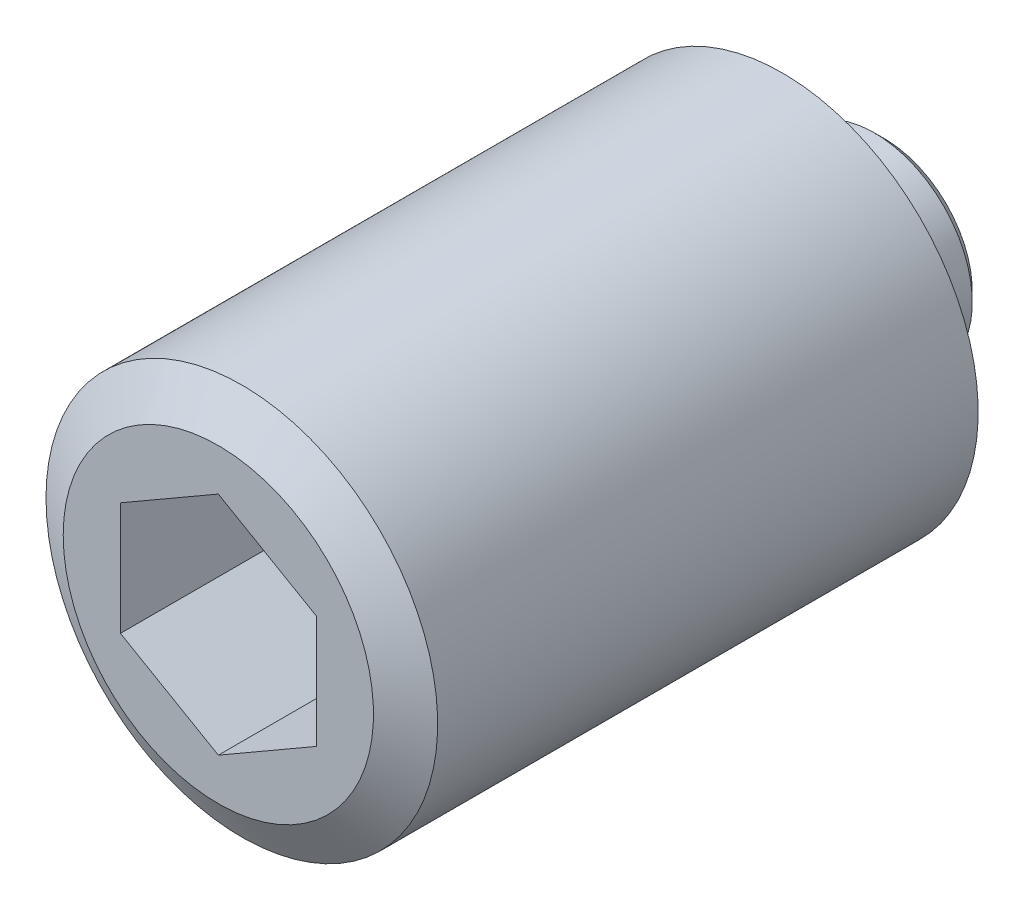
ISO-10303-21;
HEADER;
FILE_DESCRIPTION(('STEP AP214'),'2;1');
FILE_NAME('part.step','',(''),(''),'','','');
FILE_SCHEMA(('AUTOMOTIVE_DESIGN { 1 0 10303 214 1 1 1 1 }'));
ENDSEC;
DATA;
#1=APPLICATION_CONTEXT('core data for automotive mechanical design processes');
#2=APPLICATION_PROTOCOL_DEFINITION('international standard','automotive_design',2000,#1);
#3=PRODUCT_CONTEXT('',#1,'mechanical');
#4=PRODUCT('Part','Part','',(#3));
#5=PRODUCT_RELATED_PRODUCT_CATEGORY('part','',(#4));
#6=PRODUCT_DEFINITION_FORMATION('','',#4);
#7=PRODUCT_DEFINITION_CONTEXT('part definition',#1,'design');
#8=PRODUCT_DEFINITION('design','',#6,#7);
#9=PRODUCT_DEFINITION_SHAPE('','',#8);
#10=(LENGTH_UNIT() NAMED_UNIT(*) SI_UNIT(.MILLI.,.METRE.));
#11=(NAMED_UNIT(*) PLANE_ANGLE_UNIT() SI_UNIT($,.RADIAN.));
#12=(NAMED_UNIT(*) SI_UNIT($,.STERADIAN.) SOLID_ANGLE_UNIT());
#13=UNCERTAINTY_MEASURE_WITH_UNIT(LENGTH_MEASURE(1.E-05),#10,'distance_accuracy_value','');
#14=(GEOMETRIC_REPRESENTATION_CONTEXT(3) GLOBAL_UNCERTAINTY_ASSIGNED_CONTEXT((#13)) GLOBAL_UNIT_ASSIGNED_CONTEXT((#10,
#11,#12)) REPRESENTATION_CONTEXT('',''));
#15=CARTESIAN_POINT('',(0.,0.,0.));
#16=DIRECTION('',(0.,0.,1.));
#17=DIRECTION('',(1.,0.,0.));
#18=AXIS2_PLACEMENT_3D('',#15,#16,#17);
#19=CARTESIAN_POINT('',(0.,0.,0.));
#20=DIRECTION('',(0.,0.,-1.));
#21=DIRECTION('',(-1.,0.,0.));
#22=AXIS2_PLACEMENT_3D('',#19,#20,#21);
#23=PLANE('',#22);
#24=CARTESIAN_POINT('',(0.,0.,0.));
#25=DIRECTION('',(0.,0.,-1.));
#26=DIRECTION('',(-1.,0.,0.));
#27=AXIS2_PLACEMENT_3D('',#24,#25,#26);
#28=CIRCLE('',#27,4.5);
#29=CARTESIAN_POINT('',(-4.5,0.,0.));
#30=VERTEX_POINT('',#29);
#31=EDGE_CURVE('E9',#30,#30,#28,.T.);
#32=ORIENTED_EDGE('',*,*,#31,.T.);
#33=EDGE_LOOP('',(#32));
#34=FACE_BOUND('',#33,.T.);
#35=ADVANCED_FACE('F14',(#34),#23,.T.);
#36=CARTESIAN_POINT('',(0.,0.,0.));
#37=DIRECTION('',(0.,0.,1.));
#38=DIRECTION('',(1.,0.,0.));
#39=AXIS2_PLACEMENT_3D('',#36,#37,#38);
#40=CONICAL_SURFACE('',#39,4.5,0.785398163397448);
#41=CARTESIAN_POINT('',(0.,0.,0.5));
#42=DIRECTION('',(0.,0.,-1.));
#43=DIRECTION('',(-1.,0.,0.));
#44=AXIS2_PLACEMENT_3D('',#41,#42,#43);
#45=CIRCLE('',#44,5.);
#46=CARTESIAN_POINT('',(-5.,0.,0.5));
#47=VERTEX_POINT('',#46);
#48=EDGE_CURVE('E21',#47,#47,#45,.T.);
#49=ORIENTED_EDGE('',*,*,#48,.T.);
#50=EDGE_LOOP('',(#49));
#51=FACE_BOUND('',#50,.T.);
#52=ORIENTED_EDGE('',*,*,#31,.F.);
#53=EDGE_LOOP('',(#52));
#54=FACE_BOUND('',#53,.T.);
#55=ADVANCED_FACE('F143',(#51,#54),#40,.T.);
#56=CARTESIAN_POINT('',(0.,0.,-3.00000000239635));
#57=DIRECTION('',(0.,0.,-1.));
#58=DIRECTION('',(-1.,0.,0.));
#59=AXIS2_PLACEMENT_3D('',#56,#57,#58);
#60=CYLINDRICAL_SURFACE('',#59,5.);
#61=CARTESIAN_POINT('',(0.,0.,2.5));
#62=DIRECTION('',(0.,0.,-1.));
#63=DIRECTION('',(-1.,0.,0.));
#64=AXIS2_PLACEMENT_3D('',#61,#62,#63);
#65=CIRCLE('',#64,5.);
#66=CARTESIAN_POINT('',(-5.,0.,2.5));
#67=VERTEX_POINT('',#66);
#68=EDGE_CURVE('E138',#67,#67,#65,.T.);
#69=ORIENTED_EDGE('',*,*,#68,.T.);
#70=EDGE_LOOP('',(#69));
#71=FACE_BOUND('',#70,.T.);
#72=ORIENTED_EDGE('',*,*,#48,.F.);
#73=EDGE_LOOP('',(#72));
#74=FACE_BOUND('',#73,.T.);
#75=ADVANCED_FACE('F146',(#71,#74),#60,.T.);
#76=CARTESIAN_POINT('',(0.,5.19999997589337,2.5));
#77=DIRECTION('',(0.,0.,-1.));
#78=DIRECTION('',(-1.,0.,0.));
#79=AXIS2_PLACEMENT_3D('',#76,#77,#78);
#80=PLANE('',#79);
#81=CARTESIAN_POINT('',(0.,0.,2.5));
#82=DIRECTION('',(0.,0.,-1.));
#83=DIRECTION('',(-1.,0.,0.));
#84=AXIS2_PLACEMENT_3D('',#81,#82,#83);
#85=CIRCLE('',#84,5.19999997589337);
#86=CARTESIAN_POINT('',(0.,5.19999997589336,2.5));
#87=VERTEX_POINT('',#86);
#88=EDGE_CURVE('E135',#87,#87,#85,.T.);
#89=ORIENTED_EDGE('',*,*,#88,.T.);
#90=EDGE_LOOP('',(#89));
#91=FACE_BOUND('',#90,.T.);
#92=ORIENTED_EDGE('',*,*,#68,.F.);
#93=EDGE_LOOP('',(#92));
#94=FACE_BOUND('',#93,.T.);
#95=ADVANCED_FACE('F148',(#91,#94),#80,.T.);
#96=CARTESIAN_POINT('',(0.,0.,6.4));
#97=DIRECTION('',(0.,0.,-1.));
#98=DIRECTION('',(0.,1.,0.));
#99=AXIS2_PLACEMENT_3D('',#96,#97,#98);
#100=SPHERICAL_SURFACE('',#99,6.49999998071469);
#101=CARTESIAN_POINT('',(0.,0.,3.99999997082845));
#102=DIRECTION('',(0.,0.,-1.));
#103=DIRECTION('',(-1.,0.,0.));
#104=AXIS2_PLACEMENT_3D('',#101,#102,#103);
#105=CIRCLE('',#104,6.04069529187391);
#106=CARTESIAN_POINT('',(0.,6.0406952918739,3.99999997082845));
#107=VERTEX_POINT('',#106);
#108=EDGE_CURVE('E132',#107,#107,#105,.T.);
#109=CARTESIAN_POINT('',(0.,6.0406952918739,3.99999997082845));
#110=CARTESIAN_POINT('',(0.,6.03406229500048,3.98330500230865));
#111=CARTESIAN_POINT('',(0.,6.02736008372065,3.96663753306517));
#112=CARTESIAN_POINT('',(0.,6.01381770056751,3.93335873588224));
#113=CARTESIAN_POINT('',(0.,6.00697752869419,3.91674740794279));
#114=CARTESIAN_POINT('',(0.,5.99315969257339,3.8835820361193));
#115=CARTESIAN_POINT('',(0.,5.98618202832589,3.86702799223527));
#116=CARTESIAN_POINT('',(0.,5.97208968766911,3.83397832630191));
#117=CARTESIAN_POINT('',(0.,5.96497501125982,3.81748270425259));
#118=CARTESIAN_POINT('',(0.,5.95060913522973,3.78455101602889));
#119=CARTESIAN_POINT('',(0.,5.94335793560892,3.76811494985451));
#120=CARTESIAN_POINT('',(0.,5.92871951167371,3.73530350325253));
#121=CARTESIAN_POINT('',(0.,5.92133228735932,3.71892812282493));
#122=CARTESIAN_POINT('',(0.,5.90642232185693,3.68623917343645));
#123=CARTESIAN_POINT('',(0.,5.89889958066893,3.66992560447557));
#124=CARTESIAN_POINT('',(0.,5.88371909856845,3.63736139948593));
#125=CARTESIAN_POINT('',(0.,5.87606135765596,3.62111076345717));
#126=CARTESIAN_POINT('',(0.,5.86061140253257,3.58867354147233));
#127=CARTESIAN_POINT('',(0.,5.85281918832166,3.57248695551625));
#128=CARTESIAN_POINT('',(0.,5.83710082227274,3.54017894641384));
#129=CARTESIAN_POINT('',(0.,5.82917467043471,3.52405752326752));
#130=CARTESIAN_POINT('',(0.,5.81318897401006,3.49188094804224));
#131=CARTESIAN_POINT('',(0.,5.80512942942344,3.47582579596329));
#132=CARTESIAN_POINT('',(0.,5.78887750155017,3.44378286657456));
#133=CARTESIAN_POINT('',(0.,5.78068511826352,3.42779508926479));
#134=CARTESIAN_POINT('',(0.,5.76416807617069,3.39588800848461));
#135=CARTESIAN_POINT('',(0.,5.7558434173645,3.37996870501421));
#136=CARTESIAN_POINT('',(0.,5.73906239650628,3.34819966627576));
#137=CARTESIAN_POINT('',(0.,5.73060603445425,3.33234993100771));
#138=CARTESIAN_POINT('',(0.,5.71356218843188,3.30072111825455));
#139=CARTESIAN_POINT('',(0.,5.70497470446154,3.28494204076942));
#140=CARTESIAN_POINT('',(0.,5.68766920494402,3.25345562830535));
#141=CARTESIAN_POINT('',(0.,5.67895118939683,3.23774829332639));
#142=CARTESIAN_POINT('',(0.,5.66138522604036,3.20640644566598));
#143=CARTESIAN_POINT('',(0.,5.65253727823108,3.19077193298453));
#144=CARTESIAN_POINT('',(0.,5.6347120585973,3.15957680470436));
#145=CARTESIAN_POINT('',(0.,5.6257347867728,3.14401618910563));
#146=CARTESIAN_POINT('',(0.,5.60765153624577,3.11296992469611));
#147=CARTESIAN_POINT('',(0.,5.59854555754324,3.09748427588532));
#148=CARTESIAN_POINT('',(0.,5.58020551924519,3.06658900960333));
#149=CARTESIAN_POINT('',(0.,5.57097145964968,3.05117939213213));
#150=CARTESIAN_POINT('',(0.,5.55237589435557,3.02043724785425));
#151=CARTESIAN_POINT('',(0.,5.54301438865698,3.00510472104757));
#152=CARTESIAN_POINT('',(0.,5.52416457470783,2.97451781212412));
#153=CARTESIAN_POINT('',(0.,5.51467626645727,2.95926343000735));
#154=CARTESIAN_POINT('',(0.,5.49557349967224,2.92883385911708));
#155=CARTESIAN_POINT('',(0.,5.48595904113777,2.91365867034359));
#156=CARTESIAN_POINT('',(0.,5.46660463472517,2.88338852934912));
#157=CARTESIAN_POINT('',(0.,5.45686468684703,2.86829357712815));
#158=CARTESIAN_POINT('',(0.,5.43725997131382,2.8381849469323));
#159=CARTESIAN_POINT('',(0.,5.42739520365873,2.82317126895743));
#160=CARTESIAN_POINT('',(0.,5.40754152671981,2.79322621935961));
#161=CARTESIAN_POINT('',(0.,5.39755261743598,2.77829484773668));
#162=CARTESIAN_POINT('',(0.,5.37745134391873,2.74851543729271));
#163=CARTESIAN_POINT('',(0.,5.36733897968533,2.73366739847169));
#164=CARTESIAN_POINT('',(0.,5.34699149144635,2.70405567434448));
#165=CARTESIAN_POINT('',(0.,5.33675636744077,2.6892919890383));
#166=CARTESIAN_POINT('',(0.,5.31616406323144,2.65984998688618));
#167=CARTESIAN_POINT('',(0.,5.30580688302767,2.64517167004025));
#168=CARTESIAN_POINT('',(0.,5.28497117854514,2.61590141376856));
#169=CARTESIAN_POINT('',(0.,5.27449265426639,2.60130947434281));
#170=CARTESIAN_POINT('',(0.,5.25341498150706,2.57221297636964));
#171=CARTESIAN_POINT('',(0.,5.2428158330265,2.55770841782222));
#172=CARTESIAN_POINT('',(0.,5.22149764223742,2.52878767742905));
#173=CARTESIAN_POINT('',(0.,5.21077859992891,2.51437149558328));
#174=CARTESIAN_POINT('',(0.,5.19999997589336,2.5));
#175=B_SPLINE_CURVE_WITH_KNOTS('',3,(#109,#110,#111,#112,#113,#114,#115,#116,#117,#118,#119,
#120,#121,#122,#123,#124,#125,#126,#127,#128,#129,#130,#131,#132,#133,#134,#135,#136,#137,#138,
#139,#140,#141,#142,#143,#144,#145,#146,#147,#148,#149,#150,#151,#152,#153,#154,#155,#156,#157,
#158,#159,#160,#161,#162,#163,#164,#165,#166,#167,#168,#169,#170,#171,#172,#173,#174),
.UNSPECIFIED.,.F.,.F.,(4,2,2,2,2,2,2,2,2,2,2,2,2,2,2,2,2,2,2,2,2,2,2,2,2,2,2,2,2,2,2,2,4),(0.,
0.053892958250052,0.107785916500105,0.161678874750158,0.215571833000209,0.269464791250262,
0.323357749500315,0.377250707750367,0.431143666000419,0.485036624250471,0.538929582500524,
0.592822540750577,0.646715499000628,0.70060845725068,0.754501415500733,0.808394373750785,
0.862287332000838,0.91618029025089,0.970073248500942,1.02396620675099,1.07785916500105,
1.1317521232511,1.18564508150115,1.2395380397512,1.29343099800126,1.34732395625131,
1.40121691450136,1.45510987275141,1.50900283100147,1.56289578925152,1.61678874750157,
1.67068170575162,1.72457466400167),.UNSPECIFIED.);
#176=EDGE_CURVE('BSEAM157',#107,#87,#175,.T.);
#177=ORIENTED_EDGE('',*,*,#108,.T.);
#178=ORIENTED_EDGE('',*,*,#88,.F.);
#179=ORIENTED_EDGE('',*,*,#176,.T.);
#180=ORIENTED_EDGE('',*,*,#176,.F.);
#181=EDGE_LOOP('',(#177,#179,#178,#180));
#182=FACE_BOUND('',#181,.T.);
#183=ADVANCED_FACE('F157',(#182),#100,.T.);
#184=CARTESIAN_POINT('',(0.,7.921539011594,3.99999997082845));
#185=DIRECTION('',(0.,0.,-1.));
#186=DIRECTION('',(-1.,0.,0.));
#187=AXIS2_PLACEMENT_3D('',#184,#185,#186);
#188=PLANE('',#187);
#189=CARTESIAN_POINT('',(0.,0.,3.99999997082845));
#190=DIRECTION('',(0.,0.,-1.));
#191=DIRECTION('',(-1.,0.,0.));
#192=AXIS2_PLACEMENT_3D('',#189,#190,#191);
#193=CIRCLE('',#192,7.921539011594);
#194=CARTESIAN_POINT('',(-7.921539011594,0.,3.99999997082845));
#195=VERTEX_POINT('',#194);
#196=EDGE_CURVE('E129',#195,#195,#193,.T.);
#197=ORIENTED_EDGE('',*,*,#196,.T.);
#198=EDGE_LOOP('',(#197));
#199=FACE_BOUND('',#198,.T.);
#200=ORIENTED_EDGE('',*,*,#108,.F.);
#201=EDGE_LOOP('',(#200));
#202=FACE_BOUND('',#201,.T.);
#203=ADVANCED_FACE('F196',(#199,#202),#188,.T.);
#204=CARTESIAN_POINT('',(0.,0.,3.99999997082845));
#205=DIRECTION('',(0.,0.,1.));
#206=DIRECTION('',(1.,0.,0.));
#207=AXIS2_PLACEMENT_3D('',#204,#205,#206);
#208=CONICAL_SURFACE('',#207,7.921539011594,1.0471975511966);
#209=CARTESIAN_POINT('',(0.,0.,5.19999998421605));
#210=DIRECTION('',(0.,0.,-1.));
#211=DIRECTION('',(-1.,0.,0.));
#212=AXIS2_PLACEMENT_3D('',#209,#210,#211);
#213=CIRCLE('',#212,10.0000000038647);
#214=CARTESIAN_POINT('',(-10.0000000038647,0.,5.19999998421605));
#215=VERTEX_POINT('',#214);
#216=EDGE_CURVE('E126',#215,#215,#213,.T.);
#217=ORIENTED_EDGE('',*,*,#216,.T.);
#218=EDGE_LOOP('',(#217));
#219=FACE_BOUND('',#218,.T.);
#220=ORIENTED_EDGE('',*,*,#196,.F.);
#221=EDGE_LOOP('',(#220));
#222=FACE_BOUND('',#221,.T.);
#223=ADVANCED_FACE('F204',(#219,#222),#208,.T.);
#224=CARTESIAN_POINT('',(0.,0.,-3.00000000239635));
#225=DIRECTION('',(0.,0.,-1.));
#226=DIRECTION('',(-1.,0.,0.));
#227=AXIS2_PLACEMENT_3D('',#224,#225,#226);
#228=CYLINDRICAL_SURFACE('',#227,10.0000000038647);
#229=CARTESIAN_POINT('',(0.,0.,32.7999999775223));
#230=DIRECTION('',(0.,0.,-1.));
#231=DIRECTION('',(-1.,0.,0.));
#232=AXIS2_PLACEMENT_3D('',#229,#230,#231);
#233=CIRCLE('',#232,10.0000000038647);
#234=CARTESIAN_POINT('',(-10.0000000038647,0.,32.7999999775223));
#235=VERTEX_POINT('',#234);
#236=EDGE_CURVE('E123',#235,#235,#233,.T.);
#237=ORIENTED_EDGE('',*,*,#236,.T.);
#238=EDGE_LOOP('',(#237));
#239=FACE_BOUND('',#238,.T.);
#240=ORIENTED_EDGE('',*,*,#216,.F.);
#241=EDGE_LOOP('',(#240));
#242=FACE_BOUND('',#241,.T.);
#243=ADVANCED_FACE('F213',(#239,#242),#228,.T.);
#244=CARTESIAN_POINT('',(0.,0.,32.7999999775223));
#245=DIRECTION('',(0.,0.,-1.));
#246=DIRECTION('',(-1.,0.,0.));
#247=AXIS2_PLACEMENT_3D('',#244,#245,#246);
#248=CONICAL_SURFACE('',#247,10.0000000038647,1.0471975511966);
#249=CARTESIAN_POINT('',(0.,0.,33.9999999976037));
#250=DIRECTION('',(0.,0.,-1.));
#251=DIRECTION('',(-1.,0.,0.));
#252=AXIS2_PLACEMENT_3D('',#249,#250,#251);
#253=CIRCLE('',#252,7.921539);
#254=CARTESIAN_POINT('',(-7.921539,0.,33.9999999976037));
#255=VERTEX_POINT('',#254);
#256=EDGE_CURVE('E115',#255,#255,#253,.T.);
#257=ORIENTED_EDGE('',*,*,#256,.T.);
#258=EDGE_LOOP('',(#257));
#259=FACE_BOUND('',#258,.T.);
#260=ORIENTED_EDGE('',*,*,#236,.F.);
#261=EDGE_LOOP('',(#260));
#262=FACE_BOUND('',#261,.T.);
#263=ADVANCED_FACE('F222',(#259,#262),#248,.T.);
#264=CARTESIAN_POINT('',(0.,7.921539,33.9999999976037));
#265=DIRECTION('',(0.,0.,1.));
#266=DIRECTION('',(1.,0.,0.));
#267=AXIS2_PLACEMENT_3D('',#264,#265,#266);
#268=PLANE('',#267);
#269=DIRECTION('',(-0.866025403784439,0.5,0.));
#270=VECTOR('',#269,1.);
#271=CARTESIAN_POINT('',(5.,2.88675134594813,33.9999999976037));
#272=LINE('',#271,#270);
#273=CARTESIAN_POINT('',(5.,2.88675134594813,33.9999999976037));
#274=VERTEX_POINT('',#273);
#275=CARTESIAN_POINT('',(0.,5.77350269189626,33.9999999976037));
#276=VERTEX_POINT('',#275);
#277=EDGE_CURVE('E28',#274,#276,#272,.T.);
#278=ORIENTED_EDGE('',*,*,#277,.F.);
#279=DIRECTION('',(0.,1.,0.));
#280=VECTOR('',#279,1.);
#281=CARTESIAN_POINT('',(5.,-2.88675134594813,33.9999999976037));
#282=LINE('',#281,#280);
#283=CARTESIAN_POINT('',(5.,-2.88675134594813,33.9999999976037));
#284=VERTEX_POINT('',#283);
#285=EDGE_CURVE('E111',#284,#274,#282,.T.);
#286=ORIENTED_EDGE('',*,*,#285,.F.);
#287=DIRECTION('',(0.866025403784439,0.5,0.));
#288=VECTOR('',#287,1.);
#289=CARTESIAN_POINT('',(0.,-5.77350269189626,33.9999999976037));
#290=LINE('',#289,#288);
#291=CARTESIAN_POINT('',(0.,-5.77350269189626,33.9999999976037));
#292=VERTEX_POINT('',#291);
#293=EDGE_CURVE('E109',#292,#284,#290,.T.);
#294=ORIENTED_EDGE('',*,*,#293,.F.);
#295=DIRECTION('',(0.866025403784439,-0.5,0.));
#296=VECTOR('',#295,1.);
#297=CARTESIAN_POINT('',(-5.,-2.88675134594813,33.9999999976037));
#298=LINE('',#297,#296);
#299=CARTESIAN_POINT('',(-5.,-2.88675134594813,33.9999999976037));
#300=VERTEX_POINT('',#299);
#301=EDGE_CURVE('E76',#300,#292,#298,.T.);
#302=ORIENTED_EDGE('',*,*,#301,.F.);
#303=DIRECTION('',(0.,-1.,0.));
#304=VECTOR('',#303,1.);
#305=CARTESIAN_POINT('',(-5.,2.88675134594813,33.9999999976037));
#306=LINE('',#305,#304);
#307=CARTESIAN_POINT('',(-5.,2.88675134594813,33.9999999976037));
#308=VERTEX_POINT('',#307);
#309=EDGE_CURVE('E105',#308,#300,#306,.T.);
#310=ORIENTED_EDGE('',*,*,#309,.F.);
#311=DIRECTION('',(-0.866025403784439,-0.5,0.));
#312=VECTOR('',#311,1.);
#313=CARTESIAN_POINT('',(0.,5.77350269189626,33.9999999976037));
#314=LINE('',#313,#312);
#315=EDGE_CURVE('E102',#276,#308,#314,.T.);
#316=ORIENTED_EDGE('',*,*,#315,.F.);
#317=EDGE_LOOP('',(#278,#286,#294,#302,#310,#316));
#318=FACE_BOUND('',#317,.T.);
#319=ORIENTED_EDGE('',*,*,#256,.F.);
#320=EDGE_LOOP('',(#319));
#321=FACE_BOUND('',#320,.T.);
#322=ADVANCED_FACE('F231',(#318,#321),#268,.T.);
#323=CARTESIAN_POINT('',(5.,2.88675134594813,25.9999999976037));
#324=DIRECTION('',(0.5,0.866025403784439,0.));
#325=DIRECTION('',(-0.866025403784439,0.5,0.));
#326=AXIS2_PLACEMENT_3D('',#323,#324,#325);
#327=PLANE('',#326);
#328=ORIENTED_EDGE('',*,*,#277,.T.);
#329=DIRECTION('',(0.,0.,1.));
#330=VECTOR('',#329,1.);
#331=CARTESIAN_POINT('',(0.,5.77350269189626,25.9999999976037));
#332=LINE('',#331,#330);
#333=CARTESIAN_POINT('',(0.,5.77350269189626,25.9999999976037));
#334=VERTEX_POINT('',#333);
#335=EDGE_CURVE('E58',#334,#276,#332,.T.);
#336=ORIENTED_EDGE('',*,*,#335,.F.);
#337=DIRECTION('',(-0.866025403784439,0.5,0.));
#338=VECTOR('',#337,1.);
#339=CARTESIAN_POINT('',(5.,2.88675134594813,25.9999999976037));
#340=LINE('',#339,#338);
#341=CARTESIAN_POINT('',(5.,2.88675134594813,25.9999999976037));
#342=VERTEX_POINT('',#341);
#343=EDGE_CURVE('E113',#342,#334,#340,.T.);
#344=ORIENTED_EDGE('',*,*,#343,.F.);
#345=DIRECTION('',(0.,0.,1.));
#346=VECTOR('',#345,1.);
#347=CARTESIAN_POINT('',(5.,2.88675134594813,25.9999999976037));
#348=LINE('',#347,#346);
#349=EDGE_CURVE('E36',#342,#274,#348,.T.);
#350=ORIENTED_EDGE('',*,*,#349,.T.);
#351=EDGE_LOOP('',(#328,#336,#344,#350));
#352=FACE_BOUND('',#351,.T.);
#353=ADVANCED_FACE('F240',(#352),#327,.F.);
#354=CARTESIAN_POINT('',(5.,-2.88675134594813,25.9999999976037));
#355=DIRECTION('',(1.,0.,0.));
#356=DIRECTION('',(0.,0.,-1.));
#357=AXIS2_PLACEMENT_3D('',#354,#355,#356);
#358=PLANE('',#357);
#359=ORIENTED_EDGE('',*,*,#285,.T.);
#360=ORIENTED_EDGE('',*,*,#349,.F.);
#361=DIRECTION('',(0.,1.,0.));
#362=VECTOR('',#361,1.);
#363=CARTESIAN_POINT('',(5.,-2.88675134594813,25.9999999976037));
#364=LINE('',#363,#362);
#365=CARTESIAN_POINT('',(5.,-2.88675134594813,25.9999999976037));
#366=VERTEX_POINT('',#365);
#367=EDGE_CURVE('E88',#366,#342,#364,.T.);
#368=ORIENTED_EDGE('',*,*,#367,.F.);
#369=DIRECTION('',(0.,0.,1.));
#370=VECTOR('',#369,1.);
#371=CARTESIAN_POINT('',(5.,-2.88675134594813,25.9999999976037));
#372=LINE('',#371,#370);
#373=EDGE_CURVE('E80',#366,#284,#372,.T.);
#374=ORIENTED_EDGE('',*,*,#373,.T.);
#375=EDGE_LOOP('',(#359,#360,#368,#374));
#376=FACE_BOUND('',#375,.T.);
#377=ADVANCED_FACE('F249',(#376),#358,.F.);
#378=CARTESIAN_POINT('',(0.,-5.77350269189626,25.9999999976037));
#379=DIRECTION('',(0.5,-0.866025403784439,0.));
#380=DIRECTION('',(0.866025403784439,0.5,0.));
#381=AXIS2_PLACEMENT_3D('',#378,#379,#380);
#382=PLANE('',#381);
#383=ORIENTED_EDGE('',*,*,#293,.T.);
#384=ORIENTED_EDGE('',*,*,#373,.F.);
#385=DIRECTION('',(0.866025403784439,0.5,0.));
#386=VECTOR('',#385,1.);
#387=CARTESIAN_POINT('',(0.,-5.77350269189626,25.9999999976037));
#388=LINE('',#387,#386);
#389=CARTESIAN_POINT('',(0.,-5.77350269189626,25.9999999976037));
#390=VERTEX_POINT('',#389);
#391=EDGE_CURVE('E84',#390,#366,#388,.T.);
#392=ORIENTED_EDGE('',*,*,#391,.F.);
#393=DIRECTION('',(0.,0.,1.));
#394=VECTOR('',#393,1.);
#395=CARTESIAN_POINT('',(0.,-5.77350269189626,25.9999999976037));
#396=LINE('',#395,#394);
#397=EDGE_CURVE('E69',#390,#292,#396,.T.);
#398=ORIENTED_EDGE('',*,*,#397,.T.);
#399=EDGE_LOOP('',(#383,#384,#392,#398));
#400=FACE_BOUND('',#399,.T.);
#401=ADVANCED_FACE('F85',(#400),#382,.F.);
#402=CARTESIAN_POINT('',(-5.,-2.88675134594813,25.9999999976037));
#403=DIRECTION('',(-0.5,-0.866025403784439,0.));
#404=DIRECTION('',(0.866025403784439,-0.5,0.));
#405=AXIS2_PLACEMENT_3D('',#402,#403,#404);
#406=PLANE('',#405);
#407=ORIENTED_EDGE('',*,*,#301,.T.);
#408=ORIENTED_EDGE('',*,*,#397,.F.);
#409=DIRECTION('',(0.866025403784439,-0.5,0.));
#410=VECTOR('',#409,1.);
#411=CARTESIAN_POINT('',(-5.,-2.88675134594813,25.9999999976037));
#412=LINE('',#411,#410);
#413=CARTESIAN_POINT('',(-5.,-2.88675134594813,25.9999999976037));
#414=VERTEX_POINT('',#413);
#415=EDGE_CURVE('E73',#414,#390,#412,.T.);
#416=ORIENTED_EDGE('',*,*,#415,.F.);
#417=DIRECTION('',(0.,0.,1.));
#418=VECTOR('',#417,1.);
#419=CARTESIAN_POINT('',(-5.,-2.88675134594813,25.9999999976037));
#420=LINE('',#419,#418);
#421=EDGE_CURVE('E81',#414,#300,#420,.T.);
#422=ORIENTED_EDGE('',*,*,#421,.T.);
#423=EDGE_LOOP('',(#407,#408,#416,#422));
#424=FACE_BOUND('',#423,.T.);
#425=ADVANCED_FACE('F71',(#424),#406,.F.);
#426=CARTESIAN_POINT('',(-5.,2.88675134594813,25.9999999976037));
#427=DIRECTION('',(-1.,0.,0.));
#428=DIRECTION('',(0.,-1.,0.));
#429=AXIS2_PLACEMENT_3D('',#426,#427,#428);
#430=PLANE('',#429);
#431=ORIENTED_EDGE('',*,*,#309,.T.);
#432=ORIENTED_EDGE('',*,*,#421,.F.);
#433=DIRECTION('',(0.,-1.,0.));
#434=VECTOR('',#433,1.);
#435=CARTESIAN_POINT('',(-5.,2.88675134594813,25.9999999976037));
#436=LINE('',#435,#434);
#437=CARTESIAN_POINT('',(-5.,2.88675134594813,25.9999999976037));
#438=VERTEX_POINT('',#437);
#439=EDGE_CURVE('E94',#438,#414,#436,.T.);
#440=ORIENTED_EDGE('',*,*,#439,.F.);
#441=DIRECTION('',(0.,0.,1.));
#442=VECTOR('',#441,1.);
#443=CARTESIAN_POINT('',(-5.,2.88675134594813,25.9999999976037));
#444=LINE('',#443,#442);
#445=EDGE_CURVE('E118',#438,#308,#444,.T.);
#446=ORIENTED_EDGE('',*,*,#445,.T.);
#447=EDGE_LOOP('',(#431,#432,#440,#446));
#448=FACE_BOUND('',#447,.T.);
#449=ADVANCED_FACE('F271',(#448),#430,.F.);
#450=CARTESIAN_POINT('',(0.,5.77350269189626,25.9999999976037));
#451=DIRECTION('',(-0.5,0.866025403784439,0.));
#452=DIRECTION('',(-0.866025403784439,-0.5,0.));
#453=AXIS2_PLACEMENT_3D('',#450,#451,#452);
#454=PLANE('',#453);
#455=ORIENTED_EDGE('',*,*,#315,.T.);
#456=ORIENTED_EDGE('',*,*,#445,.F.);
#457=DIRECTION('',(-0.866025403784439,-0.5,0.));
#458=VECTOR('',#457,1.);
#459=CARTESIAN_POINT('',(0.,5.77350269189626,25.9999999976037));
#460=LINE('',#459,#458);
#461=EDGE_CURVE('E96',#334,#438,#460,.T.);
#462=ORIENTED_EDGE('',*,*,#461,.F.);
#463=ORIENTED_EDGE('',*,*,#335,.T.);
#464=EDGE_LOOP('',(#455,#456,#462,#463));
#465=FACE_BOUND('',#464,.T.);
#466=ADVANCED_FACE('F279',(#465),#454,.F.);
#467=CARTESIAN_POINT('',(0.,5.77350269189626,25.9999999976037));
#468=DIRECTION('',(0.,0.,1.));
#469=DIRECTION('',(1.,0.,0.));
#470=AXIS2_PLACEMENT_3D('',#467,#468,#469);
#471=PLANE('',#470);
#472=ORIENTED_EDGE('',*,*,#343,.T.);
#473=ORIENTED_EDGE('',*,*,#461,.T.);
#474=ORIENTED_EDGE('',*,*,#439,.T.);
#475=ORIENTED_EDGE('',*,*,#415,.T.);
#476=ORIENTED_EDGE('',*,*,#391,.T.);
#477=ORIENTED_EDGE('',*,*,#367,.T.);
#478=EDGE_LOOP('',(#472,#473,#474,#475,#476,#477));
#479=FACE_BOUND('',#478,.T.);
#480=ADVANCED_FACE('F91',(#479),#471,.T.);
#481=CLOSED_SHELL('',(#35,#55,#75,#95,#183,#203,#223,#243,#263,#322,#353,#377,#401,#425,#449,
#466,#480));
#482=MANIFOLD_SOLID_BREP('B1',#481);
#483=ADVANCED_BREP_SHAPE_REPRESENTATION('',(#18,#482),#14);
#484=SHAPE_DEFINITION_REPRESENTATION(#9,#483);
ENDSEC;
END-ISO-10303-21;
